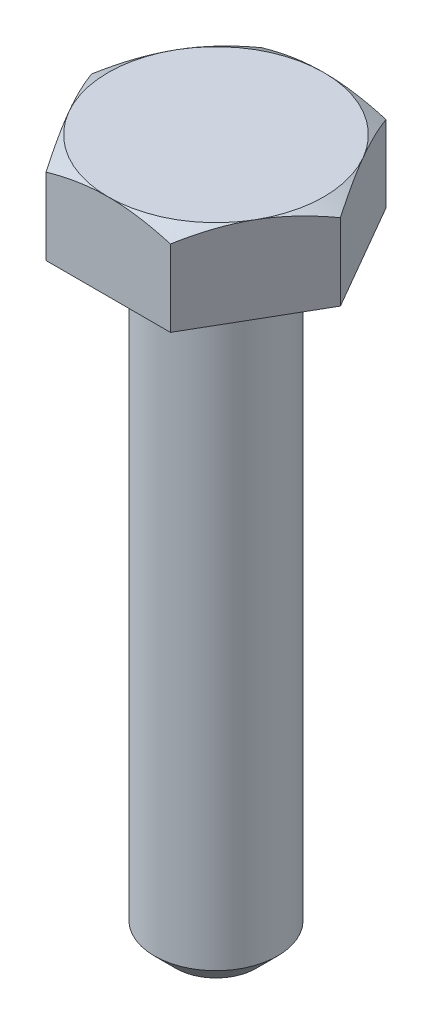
ISO-10303-21;
HEADER;
FILE_DESCRIPTION(('STEP AP214'),'2;1');
FILE_NAME('part.step','',(''),(''),'','','');
FILE_SCHEMA(('AUTOMOTIVE_DESIGN { 1 0 10303 214 1 1 1 1 }'));
ENDSEC;
DATA;
#1=APPLICATION_CONTEXT('core data for automotive mechanical design processes');
#2=APPLICATION_PROTOCOL_DEFINITION('international standard','automotive_design',2000,#1);
#3=PRODUCT_CONTEXT('',#1,'mechanical');
#4=PRODUCT('Part','Part','',(#3));
#5=PRODUCT_RELATED_PRODUCT_CATEGORY('part','',(#4));
#6=PRODUCT_DEFINITION_FORMATION('','',#4);
#7=PRODUCT_DEFINITION_CONTEXT('part definition',#1,'design');
#8=PRODUCT_DEFINITION('design','',#6,#7);
#9=PRODUCT_DEFINITION_SHAPE('','',#8);
#10=(LENGTH_UNIT() NAMED_UNIT(*) SI_UNIT(.MILLI.,.METRE.));
#11=(NAMED_UNIT(*) PLANE_ANGLE_UNIT() SI_UNIT($,.RADIAN.));
#12=(NAMED_UNIT(*) SI_UNIT($,.STERADIAN.) SOLID_ANGLE_UNIT());
#13=UNCERTAINTY_MEASURE_WITH_UNIT(LENGTH_MEASURE(1.E-05),#10,'distance_accuracy_value','');
#14=(GEOMETRIC_REPRESENTATION_CONTEXT(3) GLOBAL_UNCERTAINTY_ASSIGNED_CONTEXT((#13)) GLOBAL_UNIT_ASSIGNED_CONTEXT((#10,
#11,#12)) REPRESENTATION_CONTEXT('',''));
#15=CARTESIAN_POINT('',(0.,0.,0.));
#16=DIRECTION('',(0.,0.,1.));
#17=DIRECTION('',(1.,0.,0.));
#18=AXIS2_PLACEMENT_3D('',#15,#16,#17);
#19=CARTESIAN_POINT('',(0.,2.8,0.));
#20=DIRECTION('',(0.,-1.,0.));
#21=DIRECTION('',(1.,0.,0.));
#22=AXIS2_PLACEMENT_3D('',#19,#20,#21);
#23=PLANE('',#22);
#24=CARTESIAN_POINT('',(0.,2.79999999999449,0.));
#25=DIRECTION('',(0.,-1.,0.));
#26=DIRECTION('',(1.,0.,0.));
#27=AXIS2_PLACEMENT_3D('',#24,#25,#26);
#28=CIRCLE('',#27,3.50000000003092);
#29=CARTESIAN_POINT('',(3.03108891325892,2.80000000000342,1.75000000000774));
#30=VERTEX_POINT('',#29);
#31=CARTESIAN_POINT('',(0.,2.80000000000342,3.50000000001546));
#32=VERTEX_POINT('',#31);
#33=EDGE_CURVE('E89',#30,#32,#28,.T.);
#34=ORIENTED_EDGE('',*,*,#33,.F.);
#35=CARTESIAN_POINT('',(0.,2.79999999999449,0.));
#36=DIRECTION('',(0.,-1.,0.));
#37=DIRECTION('',(1.,0.,0.));
#38=AXIS2_PLACEMENT_3D('',#35,#36,#37);
#39=CIRCLE('',#38,3.50000000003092);
#40=CARTESIAN_POINT('',(3.03108891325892,2.80000000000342,-1.75000000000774));
#41=VERTEX_POINT('',#40);
#42=EDGE_CURVE('E87',#41,#30,#39,.T.);
#43=ORIENTED_EDGE('',*,*,#42,.F.);
#44=CARTESIAN_POINT('',(0.,2.79999999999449,0.));
#45=DIRECTION('',(0.,-1.,0.));
#46=DIRECTION('',(1.,0.,0.));
#47=AXIS2_PLACEMENT_3D('',#44,#45,#46);
#48=CIRCLE('',#47,3.50000000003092);
#49=CARTESIAN_POINT('',(0.,2.80000000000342,-3.50000000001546));
#50=VERTEX_POINT('',#49);
#51=EDGE_CURVE('E20',#50,#41,#48,.T.);
#52=ORIENTED_EDGE('',*,*,#51,.F.);
#53=CARTESIAN_POINT('',(0.,2.79999999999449,0.));
#54=DIRECTION('',(0.,-1.,0.));
#55=DIRECTION('',(1.,0.,0.));
#56=AXIS2_PLACEMENT_3D('',#53,#54,#55);
#57=CIRCLE('',#56,3.50000000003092);
#58=CARTESIAN_POINT('',(-3.03108891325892,2.80000000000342,-1.75000000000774));
#59=VERTEX_POINT('',#58);
#60=EDGE_CURVE('E104',#59,#50,#57,.T.);
#61=ORIENTED_EDGE('',*,*,#60,.F.);
#62=CARTESIAN_POINT('',(0.,2.79999999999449,0.));
#63=DIRECTION('',(0.,-1.,0.));
#64=DIRECTION('',(1.,0.,0.));
#65=AXIS2_PLACEMENT_3D('',#62,#63,#64);
#66=CIRCLE('',#65,3.50000000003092);
#67=CARTESIAN_POINT('',(-3.03108891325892,2.80000000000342,1.75000000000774));
#68=VERTEX_POINT('',#67);
#69=EDGE_CURVE('E323',#68,#59,#66,.T.);
#70=ORIENTED_EDGE('',*,*,#69,.F.);
#71=CARTESIAN_POINT('',(0.,2.79999999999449,0.));
#72=DIRECTION('',(0.,-1.,0.));
#73=DIRECTION('',(1.,0.,0.));
#74=AXIS2_PLACEMENT_3D('',#71,#72,#73);
#75=CIRCLE('',#74,3.50000000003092);
#76=EDGE_CURVE('E93',#32,#68,#75,.T.);
#77=ORIENTED_EDGE('',*,*,#76,.F.);
#78=EDGE_LOOP('',(#34,#43,#52,#61,#70,#77));
#79=FACE_BOUND('',#78,.T.);
#80=ADVANCED_FACE('F16',(#79),#23,.F.);
#81=CARTESIAN_POINT('',(0.,2.48551696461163,0.));
#82=DIRECTION('',(0.,-1.,0.));
#83=DIRECTION('',(1.,0.,0.));
#84=AXIS2_PLACEMENT_3D('',#81,#82,#83);
#85=CONICAL_SURFACE('',#84,4.04470059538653,1.04719755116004);
#86=ORIENTED_EDGE('',*,*,#51,.T.);
#87=CARTESIAN_POINT('',(2.02072594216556,2.4873926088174,-3.49999999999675));
#88=CARTESIAN_POINT('',(2.10296905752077,2.53488760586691,-3.35755074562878));
#89=CARTESIAN_POINT('',(2.18587080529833,2.5784013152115,-3.21396070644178));
#90=CARTESIAN_POINT('',(2.3524050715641,2.65513695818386,-2.92551489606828));
#91=CARTESIAN_POINT('',(2.43603178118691,2.68840978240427,-2.78066918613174));
#92=CARTESIAN_POINT('',(2.56226107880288,2.72926316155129,-2.56203362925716));
#93=CARTESIAN_POINT('',(2.60449696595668,2.741376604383,-2.48887892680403));
#94=CARTESIAN_POINT('',(2.68917094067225,2.762345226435,-2.34221930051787));
#95=CARTESIAN_POINT('',(2.7316090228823,2.771200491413,-2.26871438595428));
#96=CARTESIAN_POINT('',(2.81684436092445,2.78549717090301,-2.12108244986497));
#97=CARTESIAN_POINT('',(2.85964235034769,2.79092122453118,-2.04695415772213));
#98=CARTESIAN_POINT('',(2.94532249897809,2.79818014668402,-1.89855178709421));
#99=CARTESIAN_POINT('',(2.98820467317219,2.80001430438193,-1.82427768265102));
#100=CARTESIAN_POINT('',(3.03108891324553,2.80000000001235,-1.75000000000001));
#101=B_SPLINE_CURVE_WITH_KNOTS('',3,(#87,#88,#89,#90,#91,#92,#93,#94,#95,#96,#97,#98,#99,#100),
.UNSPECIFIED.,.F.,.F.,(4,2,2,2,2,2,4),(0.,0.513825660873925,1.02505510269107,1.28100524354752,
1.53694864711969,1.7941769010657,2.05145608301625),.UNSPECIFIED.);
#102=CARTESIAN_POINT('',(2.02072594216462,2.48739260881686,-3.49999999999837));
#103=VERTEX_POINT('',#102);
#104=EDGE_CURVE('E99',#103,#41,#101,.T.);
#105=ORIENTED_EDGE('',*,*,#104,.F.);
#106=CARTESIAN_POINT('',(0.,2.80000000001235,-3.49999999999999));
#107=CARTESIAN_POINT('',(0.0857684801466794,2.80001430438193,-3.49999999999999));
#108=CARTESIAN_POINT('',(0.171532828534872,2.79818014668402,-3.49999999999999));
#109=CARTESIAN_POINT('',(0.342893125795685,2.79092122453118,-3.49999999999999));
#110=CARTESIAN_POINT('',(0.428489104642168,2.78549717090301,-3.49999999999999));
#111=CARTESIAN_POINT('',(0.598959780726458,2.77120049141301,-3.49999999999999));
#112=CARTESIAN_POINT('',(0.683835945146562,2.76234522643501,-3.49999999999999));
#113=CARTESIAN_POINT('',(0.853183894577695,2.74137660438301,-3.49999999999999));
#114=CARTESIAN_POINT('',(0.937655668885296,2.7292631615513,-3.49999999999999));
#115=CARTESIAN_POINT('',(1.19011426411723,2.68840978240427,-3.49999999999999));
#116=CARTESIAN_POINT('',(1.35736768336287,2.65513695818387,-3.49999999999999));
#117=CARTESIAN_POINT('',(1.69043621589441,2.5784013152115,-3.49999999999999));
#118=CARTESIAN_POINT('',(1.85623971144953,2.53488760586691,-3.49999999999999));
#119=CARTESIAN_POINT('',(2.02072594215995,2.4873926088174,-3.49999999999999));
#120=B_SPLINE_CURVE_WITH_KNOTS('',3,(#106,#107,#108,#109,#110,#111,#112,#113,#114,#115,#116,
#117,#118,#119),.UNSPECIFIED.,.F.,.F.,(4,2,2,2,2,2,4),(0.,0.257279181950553,0.514507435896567,
0.770450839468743,1.02640098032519,1.53763042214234,2.05145608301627),.UNSPECIFIED.);
#121=EDGE_CURVE('E102',#50,#103,#120,.T.);
#122=ORIENTED_EDGE('',*,*,#121,.F.);
#123=EDGE_LOOP('',(#86,#105,#122));
#124=FACE_BOUND('',#123,.T.);
#125=ADVANCED_FACE('F97',(#124),#85,.T.);
#126=CARTESIAN_POINT('',(0.,2.48551696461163,0.));
#127=DIRECTION('',(0.,-1.,0.));
#128=DIRECTION('',(1.,0.,0.));
#129=AXIS2_PLACEMENT_3D('',#126,#127,#128);
#130=CONICAL_SURFACE('',#129,4.04470059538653,1.04719755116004);
#131=ORIENTED_EDGE('',*,*,#60,.T.);
#132=CARTESIAN_POINT('',(-2.02072594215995,2.4873926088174,-3.49999999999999));
#133=CARTESIAN_POINT('',(-1.85623971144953,2.53488760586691,-3.49999999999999));
#134=CARTESIAN_POINT('',(-1.69043621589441,2.5784013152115,-3.49999999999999));
#135=CARTESIAN_POINT('',(-1.35736768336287,2.65513695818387,-3.49999999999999));
#136=CARTESIAN_POINT('',(-1.19011426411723,2.68840978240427,-3.49999999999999));
#137=CARTESIAN_POINT('',(-0.937655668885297,2.7292631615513,-3.49999999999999));
#138=CARTESIAN_POINT('',(-0.853183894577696,2.74137660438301,-3.49999999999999));
#139=CARTESIAN_POINT('',(-0.683835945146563,2.76234522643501,-3.49999999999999));
#140=CARTESIAN_POINT('',(-0.598959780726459,2.77120049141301,-3.49999999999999));
#141=CARTESIAN_POINT('',(-0.428489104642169,2.78549717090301,-3.49999999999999));
#142=CARTESIAN_POINT('',(-0.342893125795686,2.79092122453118,-3.49999999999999));
#143=CARTESIAN_POINT('',(-0.171532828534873,2.79818014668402,-3.49999999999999));
#144=CARTESIAN_POINT('',(-0.0857684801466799,2.80001430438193,-3.49999999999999));
#145=CARTESIAN_POINT('',(0.,2.80000000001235,-3.49999999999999));
#146=B_SPLINE_CURVE_WITH_KNOTS('',3,(#132,#133,#134,#135,#136,#137,#138,#139,#140,#141,#142,
#143,#144,#145),.UNSPECIFIED.,.F.,.F.,(4,2,2,2,2,2,4),(0.,0.513825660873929,1.02505510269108,
1.28100524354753,1.53694864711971,1.79417690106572,2.05145608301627),.UNSPECIFIED.);
#147=CARTESIAN_POINT('',(-2.02072594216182,2.48739260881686,-3.49999999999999));
#148=VERTEX_POINT('',#147);
#149=EDGE_CURVE('E113',#148,#50,#146,.T.);
#150=ORIENTED_EDGE('',*,*,#149,.F.);
#151=CARTESIAN_POINT('',(-3.03108891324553,2.80000000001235,-1.75000000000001));
#152=CARTESIAN_POINT('',(-2.98820467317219,2.80001430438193,-1.82427768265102));
#153=CARTESIAN_POINT('',(-2.94532249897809,2.79818014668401,-1.89855178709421));
#154=CARTESIAN_POINT('',(-2.85964235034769,2.79092122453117,-2.04695415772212));
#155=CARTESIAN_POINT('',(-2.81684436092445,2.78549717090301,-2.12108244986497));
#156=CARTESIAN_POINT('',(-2.7316090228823,2.771200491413,-2.26871438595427));
#157=CARTESIAN_POINT('',(-2.68917094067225,2.762345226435,-2.34221930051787));
#158=CARTESIAN_POINT('',(-2.60449696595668,2.741376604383,-2.48887892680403));
#159=CARTESIAN_POINT('',(-2.56226107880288,2.72926316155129,-2.56203362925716));
#160=CARTESIAN_POINT('',(-2.43603178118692,2.68840978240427,-2.78066918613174));
#161=CARTESIAN_POINT('',(-2.3524050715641,2.65513695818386,-2.92551489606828));
#162=CARTESIAN_POINT('',(-2.18587080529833,2.5784013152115,-3.21396070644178));
#163=CARTESIAN_POINT('',(-2.10296905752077,2.53488760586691,-3.35755074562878));
#164=CARTESIAN_POINT('',(-2.02072594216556,2.4873926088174,-3.49999999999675));
#165=B_SPLINE_CURVE_WITH_KNOTS('',3,(#151,#152,#153,#154,#155,#156,#157,#158,#159,#160,#161,
#162,#163,#164),.UNSPECIFIED.,.F.,.F.,(4,2,2,2,2,2,4),(0.,0.257279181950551,0.514507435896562,
0.770450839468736,1.02640098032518,1.53763042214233,2.05145608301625),.UNSPECIFIED.);
#166=EDGE_CURVE('E169',#59,#148,#165,.T.);
#167=ORIENTED_EDGE('',*,*,#166,.F.);
#168=EDGE_LOOP('',(#131,#150,#167));
#169=FACE_BOUND('',#168,.T.);
#170=ADVANCED_FACE('F137',(#169),#130,.T.);
#171=CARTESIAN_POINT('',(0.,2.48551696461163,0.));
#172=DIRECTION('',(0.,-1.,0.));
#173=DIRECTION('',(1.,0.,0.));
#174=AXIS2_PLACEMENT_3D('',#171,#172,#173);
#175=CONICAL_SURFACE('',#174,4.04470059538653,1.04719755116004);
#176=ORIENTED_EDGE('',*,*,#69,.T.);
#177=CARTESIAN_POINT('',(-4.04145188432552,2.48739260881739,-3.24094856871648E-12));
#178=CARTESIAN_POINT('',(-3.95920876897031,2.5348876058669,-0.142449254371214));
#179=CARTESIAN_POINT('',(-3.87630702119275,2.57840131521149,-0.286039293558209));
#180=CARTESIAN_POINT('',(-3.70977275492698,2.65513695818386,-0.574485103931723));
#181=CARTESIAN_POINT('',(-3.62614604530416,2.68840978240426,-0.719330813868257));
#182=CARTESIAN_POINT('',(-3.49991674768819,2.72926316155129,-0.937966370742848));
#183=CARTESIAN_POINT('',(-3.45768086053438,2.741376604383,-1.01112107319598));
#184=CARTESIAN_POINT('',(-3.37300688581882,2.762345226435,-1.15778069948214));
#185=CARTESIAN_POINT('',(-3.33056880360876,2.771200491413,-1.23128561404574));
#186=CARTESIAN_POINT('',(-3.24533346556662,2.78549717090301,-1.37891755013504));
#187=CARTESIAN_POINT('',(-3.20253547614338,2.79092122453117,-1.45304584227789));
#188=CARTESIAN_POINT('',(-3.11685532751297,2.79818014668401,-1.60144821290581));
#189=CARTESIAN_POINT('',(-3.07397315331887,2.80001430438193,-1.675722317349));
#190=CARTESIAN_POINT('',(-3.03108891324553,2.80000000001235,-1.75000000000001));
#191=B_SPLINE_CURVE_WITH_KNOTS('',3,(#177,#178,#179,#180,#181,#182,#183,#184,#185,#186,#187,
#188,#189,#190),.UNSPECIFIED.,.F.,.F.,(4,2,2,2,2,2,4),(0.,0.513825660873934,1.02505510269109,
1.28100524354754,1.53694864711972,1.79417690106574,2.05145608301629),.UNSPECIFIED.);
#192=CARTESIAN_POINT('',(-4.04145188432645,2.48739260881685,-1.62018098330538E-12));
#193=VERTEX_POINT('',#192);
#194=EDGE_CURVE('E146',#193,#59,#191,.T.);
#195=ORIENTED_EDGE('',*,*,#194,.F.);
#196=CARTESIAN_POINT('',(-3.03108891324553,2.80000000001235,1.75000000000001));
#197=CARTESIAN_POINT('',(-3.07397315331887,2.80001430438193,1.675722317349));
#198=CARTESIAN_POINT('',(-3.11685532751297,2.79818014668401,1.60144821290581));
#199=CARTESIAN_POINT('',(-3.20253547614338,2.79092122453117,1.45304584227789));
#200=CARTESIAN_POINT('',(-3.24533346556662,2.78549717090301,1.37891755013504));
#201=CARTESIAN_POINT('',(-3.33056880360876,2.771200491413,1.23128561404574));
#202=CARTESIAN_POINT('',(-3.37300688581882,2.762345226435,1.15778069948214));
#203=CARTESIAN_POINT('',(-3.45768086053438,2.741376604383,1.01112107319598));
#204=CARTESIAN_POINT('',(-3.49991674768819,2.72926316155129,0.937966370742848));
#205=CARTESIAN_POINT('',(-3.62614604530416,2.68840978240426,0.719330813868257));
#206=CARTESIAN_POINT('',(-3.70977275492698,2.65513695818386,0.574485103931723));
#207=CARTESIAN_POINT('',(-3.87630702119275,2.57840131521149,0.286039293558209));
#208=CARTESIAN_POINT('',(-3.95920876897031,2.5348876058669,0.142449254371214));
#209=CARTESIAN_POINT('',(-4.04145188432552,2.48739260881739,3.2412585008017E-12));
#210=B_SPLINE_CURVE_WITH_KNOTS('',3,(#196,#197,#198,#199,#200,#201,#202,#203,#204,#205,#206,
#207,#208,#209),.UNSPECIFIED.,.F.,.F.,(4,2,2,2,2,2,4),(0.,0.257279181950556,0.514507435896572,
0.77045083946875,1.0264009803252,1.53763042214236,2.05145608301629),.UNSPECIFIED.);
#211=EDGE_CURVE('E183',#68,#193,#210,.T.);
#212=ORIENTED_EDGE('',*,*,#211,.F.);
#213=EDGE_LOOP('',(#176,#195,#212));
#214=FACE_BOUND('',#213,.T.);
#215=ADVANCED_FACE('F191',(#214),#175,.T.);
#216=CARTESIAN_POINT('',(0.,2.48551696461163,0.));
#217=DIRECTION('',(0.,-1.,0.));
#218=DIRECTION('',(1.,0.,0.));
#219=AXIS2_PLACEMENT_3D('',#216,#217,#218);
#220=CONICAL_SURFACE('',#219,4.04470059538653,1.04719755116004);
#221=ORIENTED_EDGE('',*,*,#76,.T.);
#222=CARTESIAN_POINT('',(-2.02072594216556,2.4873926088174,3.49999999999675));
#223=CARTESIAN_POINT('',(-2.10296905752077,2.53488760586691,3.35755074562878));
#224=CARTESIAN_POINT('',(-2.18587080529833,2.5784013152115,3.21396070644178));
#225=CARTESIAN_POINT('',(-2.3524050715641,2.65513695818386,2.92551489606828));
#226=CARTESIAN_POINT('',(-2.43603178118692,2.68840978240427,2.78066918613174));
#227=CARTESIAN_POINT('',(-2.56226107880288,2.72926316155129,2.56203362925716));
#228=CARTESIAN_POINT('',(-2.60449696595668,2.741376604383,2.48887892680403));
#229=CARTESIAN_POINT('',(-2.68917094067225,2.762345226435,2.34221930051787));
#230=CARTESIAN_POINT('',(-2.7316090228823,2.771200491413,2.26871438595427));
#231=CARTESIAN_POINT('',(-2.81684436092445,2.78549717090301,2.12108244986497));
#232=CARTESIAN_POINT('',(-2.85964235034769,2.79092122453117,2.04695415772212));
#233=CARTESIAN_POINT('',(-2.94532249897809,2.79818014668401,1.89855178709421));
#234=CARTESIAN_POINT('',(-2.98820467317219,2.80001430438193,1.82427768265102));
#235=CARTESIAN_POINT('',(-3.03108891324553,2.80000000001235,1.75000000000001));
#236=B_SPLINE_CURVE_WITH_KNOTS('',3,(#222,#223,#224,#225,#226,#227,#228,#229,#230,#231,#232,
#233,#234,#235),.UNSPECIFIED.,.F.,.F.,(4,2,2,2,2,2,4),(0.,0.513825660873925,1.02505510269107,
1.28100524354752,1.53694864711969,1.7941769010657,2.05145608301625),.UNSPECIFIED.);
#237=CARTESIAN_POINT('',(-2.02072594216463,2.48739260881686,3.49999999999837));
#238=VERTEX_POINT('',#237);
#239=EDGE_CURVE('E176',#238,#68,#236,.T.);
#240=ORIENTED_EDGE('',*,*,#239,.F.);
#241=CARTESIAN_POINT('',(0.,2.80000000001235,3.49999999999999));
#242=CARTESIAN_POINT('',(-0.0857684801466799,2.80001430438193,3.49999999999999));
#243=CARTESIAN_POINT('',(-0.171532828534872,2.79818014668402,3.49999999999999));
#244=CARTESIAN_POINT('',(-0.342893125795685,2.79092122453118,3.49999999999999));
#245=CARTESIAN_POINT('',(-0.428489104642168,2.78549717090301,3.49999999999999));
#246=CARTESIAN_POINT('',(-0.598959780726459,2.77120049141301,3.49999999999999));
#247=CARTESIAN_POINT('',(-0.683835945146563,2.76234522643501,3.49999999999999));
#248=CARTESIAN_POINT('',(-0.853183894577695,2.74137660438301,3.49999999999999));
#249=CARTESIAN_POINT('',(-0.937655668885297,2.7292631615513,3.49999999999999));
#250=CARTESIAN_POINT('',(-1.19011426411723,2.68840978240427,3.49999999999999));
#251=CARTESIAN_POINT('',(-1.35736768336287,2.65513695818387,3.49999999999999));
#252=CARTESIAN_POINT('',(-1.69043621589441,2.5784013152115,3.49999999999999));
#253=CARTESIAN_POINT('',(-1.85623971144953,2.53488760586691,3.49999999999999));
#254=CARTESIAN_POINT('',(-2.02072594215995,2.4873926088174,3.49999999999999));
#255=B_SPLINE_CURVE_WITH_KNOTS('',3,(#241,#242,#243,#244,#245,#246,#247,#248,#249,#250,#251,
#252,#253,#254),.UNSPECIFIED.,.F.,.F.,(4,2,2,2,2,2,4),(0.,0.257279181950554,0.514507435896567,
0.770450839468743,1.02640098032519,1.53763042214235,2.05145608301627),.UNSPECIFIED.);
#256=EDGE_CURVE('E198',#32,#238,#255,.T.);
#257=ORIENTED_EDGE('',*,*,#256,.F.);
#258=EDGE_LOOP('',(#221,#240,#257));
#259=FACE_BOUND('',#258,.T.);
#260=ADVANCED_FACE('F188',(#259),#220,.T.);
#261=CARTESIAN_POINT('',(0.,2.48551696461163,0.));
#262=DIRECTION('',(0.,-1.,0.));
#263=DIRECTION('',(1.,0.,0.));
#264=AXIS2_PLACEMENT_3D('',#261,#262,#263);
#265=CONICAL_SURFACE('',#264,4.04470059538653,1.04719755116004);
#266=ORIENTED_EDGE('',*,*,#42,.T.);
#267=CARTESIAN_POINT('',(4.04145188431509,2.48739260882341,2.13024001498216E-11));
#268=CARTESIAN_POINT('',(3.9592087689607,2.53488760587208,0.142449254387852));
#269=CARTESIAN_POINT('',(3.87630702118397,2.57840131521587,0.286039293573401));
#270=CARTESIAN_POINT('',(3.70977275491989,2.65513695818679,0.574485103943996));
#271=CARTESIAN_POINT('',(3.62614604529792,2.68840978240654,0.719330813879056));
#272=CARTESIAN_POINT('',(3.49991674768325,2.72926316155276,0.937966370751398));
#273=CARTESIAN_POINT('',(3.45768086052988,2.74137660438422,1.01112107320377));
#274=CARTESIAN_POINT('',(3.3730068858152,2.76234522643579,1.15778069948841));
#275=CARTESIAN_POINT('',(3.33056880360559,2.77120049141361,1.23128561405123));
#276=CARTESIAN_POINT('',(3.24533346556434,2.78549717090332,1.37891755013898));
#277=CARTESIAN_POINT('',(3.20253547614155,2.79092122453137,1.45304584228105));
#278=CARTESIAN_POINT('',(3.11685532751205,2.79818014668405,1.60144821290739));
#279=CARTESIAN_POINT('',(3.07397315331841,2.80001430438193,1.6757223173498));
#280=CARTESIAN_POINT('',(3.03108891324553,2.80000000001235,1.75000000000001));
#281=B_SPLINE_CURVE_WITH_KNOTS('',3,(#267,#268,#269,#270,#271,#272,#273,#274,#275,#276,#277,
#278,#279,#280),.UNSPECIFIED.,.F.,.F.,(4,2,2,2,2,2,4),(0.,0.51382566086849,1.02505510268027,
1.28100524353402,1.53694864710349,1.79417690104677,2.05145608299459),.UNSPECIFIED.);
#282=CARTESIAN_POINT('',(4.04145188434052,2.48739260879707,-1.0651035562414E-11));
#283=VERTEX_POINT('',#282);
#284=EDGE_CURVE('E109',#283,#30,#281,.T.);
#285=ORIENTED_EDGE('',*,*,#284,.F.);
#286=CARTESIAN_POINT('',(3.03108891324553,2.80000000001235,-1.75000000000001));
#287=CARTESIAN_POINT('',(3.07397315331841,2.80001430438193,-1.6757223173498));
#288=CARTESIAN_POINT('',(3.11685532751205,2.79818014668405,-1.60144821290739));
#289=CARTESIAN_POINT('',(3.20253547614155,2.79092122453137,-1.45304584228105));
#290=CARTESIAN_POINT('',(3.24533346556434,2.78549717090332,-1.37891755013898));
#291=CARTESIAN_POINT('',(3.33056880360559,2.77120049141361,-1.23128561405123));
#292=CARTESIAN_POINT('',(3.3730068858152,2.76234522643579,-1.15778069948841));
#293=CARTESIAN_POINT('',(3.45768086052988,2.74137660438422,-1.01112107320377));
#294=CARTESIAN_POINT('',(3.49991674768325,2.72926316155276,-0.937966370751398));
#295=CARTESIAN_POINT('',(3.62614604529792,2.68840978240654,-0.719330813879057));
#296=CARTESIAN_POINT('',(3.70977275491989,2.65513695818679,-0.574485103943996));
#297=CARTESIAN_POINT('',(3.87630702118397,2.57840131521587,-0.286039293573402));
#298=CARTESIAN_POINT('',(3.9592087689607,2.53488760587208,-0.142449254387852));
#299=CARTESIAN_POINT('',(4.04145188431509,2.48739260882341,-2.13026023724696E-11));
#300=B_SPLINE_CURVE_WITH_KNOTS('',3,(#286,#287,#288,#289,#290,#291,#292,#293,#294,#295,#296,
#297,#298,#299),.UNSPECIFIED.,.F.,.F.,(4,2,2,2,2,2,4),(0.,0.257279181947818,0.514507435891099,
0.770450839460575,1.02640098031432,1.5376304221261,2.05145608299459),.UNSPECIFIED.);
#301=EDGE_CURVE('E106',#41,#283,#300,.T.);
#302=ORIENTED_EDGE('',*,*,#301,.F.);
#303=EDGE_LOOP('',(#266,#285,#302));
#304=FACE_BOUND('',#303,.T.);
#305=ADVANCED_FACE('F107',(#304),#265,.T.);
#306=CARTESIAN_POINT('',(0.,2.48551696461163,0.));
#307=DIRECTION('',(0.,-1.,0.));
#308=DIRECTION('',(1.,0.,0.));
#309=AXIS2_PLACEMENT_3D('',#306,#307,#308);
#310=CONICAL_SURFACE('',#309,4.04470059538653,1.04719755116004);
#311=ORIENTED_EDGE('',*,*,#33,.T.);
#312=CARTESIAN_POINT('',(2.02072594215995,2.4873926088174,3.49999999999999));
#313=CARTESIAN_POINT('',(1.85623971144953,2.53488760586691,3.49999999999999));
#314=CARTESIAN_POINT('',(1.69043621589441,2.5784013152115,3.49999999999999));
#315=CARTESIAN_POINT('',(1.35736768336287,2.65513695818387,3.49999999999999));
#316=CARTESIAN_POINT('',(1.19011426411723,2.68840978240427,3.49999999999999));
#317=CARTESIAN_POINT('',(0.937655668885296,2.7292631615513,3.49999999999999));
#318=CARTESIAN_POINT('',(0.853183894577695,2.74137660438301,3.49999999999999));
#319=CARTESIAN_POINT('',(0.683835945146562,2.76234522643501,3.49999999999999));
#320=CARTESIAN_POINT('',(0.598959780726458,2.77120049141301,3.49999999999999));
#321=CARTESIAN_POINT('',(0.428489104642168,2.78549717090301,3.49999999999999));
#322=CARTESIAN_POINT('',(0.342893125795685,2.79092122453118,3.49999999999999));
#323=CARTESIAN_POINT('',(0.171532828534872,2.79818014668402,3.49999999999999));
#324=CARTESIAN_POINT('',(0.0857684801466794,2.80001430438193,3.49999999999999));
#325=CARTESIAN_POINT('',(0.,2.80000000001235,3.49999999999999));
#326=B_SPLINE_CURVE_WITH_KNOTS('',3,(#312,#313,#314,#315,#316,#317,#318,#319,#320,#321,#322,
#323,#324,#325),.UNSPECIFIED.,.F.,.F.,(4,2,2,2,2,2,4),(0.,0.513825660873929,1.02505510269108,
1.28100524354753,1.53694864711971,1.79417690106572,2.05145608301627),.UNSPECIFIED.);
#327=CARTESIAN_POINT('',(2.02072594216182,2.48739260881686,3.49999999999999));
#328=VERTEX_POINT('',#327);
#329=EDGE_CURVE('E205',#328,#32,#326,.T.);
#330=ORIENTED_EDGE('',*,*,#329,.F.);
#331=CARTESIAN_POINT('',(3.03108891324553,2.80000000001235,1.75000000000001));
#332=CARTESIAN_POINT('',(2.98820467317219,2.80001430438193,1.82427768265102));
#333=CARTESIAN_POINT('',(2.94532249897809,2.79818014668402,1.89855178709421));
#334=CARTESIAN_POINT('',(2.85964235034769,2.79092122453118,2.04695415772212));
#335=CARTESIAN_POINT('',(2.81684436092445,2.78549717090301,2.12108244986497));
#336=CARTESIAN_POINT('',(2.7316090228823,2.771200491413,2.26871438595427));
#337=CARTESIAN_POINT('',(2.68917094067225,2.762345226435,2.34221930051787));
#338=CARTESIAN_POINT('',(2.60449696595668,2.741376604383,2.48887892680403));
#339=CARTESIAN_POINT('',(2.56226107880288,2.72926316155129,2.56203362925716));
#340=CARTESIAN_POINT('',(2.43603178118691,2.68840978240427,2.78066918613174));
#341=CARTESIAN_POINT('',(2.3524050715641,2.65513695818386,2.92551489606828));
#342=CARTESIAN_POINT('',(2.18587080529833,2.5784013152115,3.21396070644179));
#343=CARTESIAN_POINT('',(2.10296905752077,2.53488760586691,3.35755074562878));
#344=CARTESIAN_POINT('',(2.02072594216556,2.4873926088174,3.49999999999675));
#345=B_SPLINE_CURVE_WITH_KNOTS('',3,(#331,#332,#333,#334,#335,#336,#337,#338,#339,#340,#341,
#342,#343,#344),.UNSPECIFIED.,.F.,.F.,(4,2,2,2,2,2,4),(0.,0.257279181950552,0.514507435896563,
0.770450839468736,1.02640098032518,1.53763042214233,2.05145608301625),.UNSPECIFIED.);
#346=EDGE_CURVE('E225',#30,#328,#345,.T.);
#347=ORIENTED_EDGE('',*,*,#346,.F.);
#348=EDGE_LOOP('',(#311,#330,#347));
#349=FACE_BOUND('',#348,.T.);
#350=ADVANCED_FACE('F233',(#349),#310,.T.);
#351=CARTESIAN_POINT('',(0.,-20.,0.));
#352=DIRECTION('',(0.,1.,0.));
#353=DIRECTION('',(0.,0.,1.));
#354=AXIS2_PLACEMENT_3D('',#351,#352,#353);
#355=PLANE('',#354);
#356=CARTESIAN_POINT('',(0.,-19.999999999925,0.));
#357=DIRECTION('',(0.,1.,0.));
#358=DIRECTION('',(0.,0.,1.));
#359=AXIS2_PLACEMENT_3D('',#356,#357,#358);
#360=CIRCLE('',#359,1.30000000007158);
#361=CARTESIAN_POINT('',(0.,-19.999999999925,1.30000000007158));
#362=VERTEX_POINT('',#361);
#363=EDGE_CURVE('E232',#362,#362,#360,.T.);
#364=ORIENTED_EDGE('',*,*,#363,.F.);
#365=EDGE_LOOP('',(#364));
#366=FACE_BOUND('',#365,.T.);
#367=ADVANCED_FACE('F236',(#366),#355,.F.);
#368=CARTESIAN_POINT('',(2.02072594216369,16.94,-3.49999999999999));
#369=DIRECTION('',(0.866025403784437,0.,-0.500000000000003));
#370=DIRECTION('',(-0.500000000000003,0.,-0.866025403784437));
#371=AXIS2_PLACEMENT_3D('',#368,#369,#370);
#372=PLANE('',#371);
#373=DIRECTION('',(-0.500000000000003,0.,-0.866025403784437));
#374=VECTOR('',#373,1.);
#375=CARTESIAN_POINT('',(4.04145188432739,0.,0.));
#376=LINE('',#375,#374);
#377=CARTESIAN_POINT('',(4.04145188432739,0.,0.));
#378=VERTEX_POINT('',#377);
#379=CARTESIAN_POINT('',(2.02072594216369,0.,-3.49999999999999));
#380=VERTEX_POINT('',#379);
#381=EDGE_CURVE('E268',#378,#380,#376,.T.);
#382=ORIENTED_EDGE('',*,*,#381,.T.);
#383=DIRECTION('',(0.,1.,0.));
#384=VECTOR('',#383,1.);
#385=CARTESIAN_POINT('',(2.02072594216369,16.94,-3.49999999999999));
#386=LINE('',#385,#384);
#387=EDGE_CURVE('E117',#103,#380,#386,.F.);
#388=ORIENTED_EDGE('',*,*,#387,.F.);
#389=ORIENTED_EDGE('',*,*,#104,.T.);
#390=ORIENTED_EDGE('',*,*,#301,.T.);
#391=DIRECTION('',(0.,1.,0.));
#392=VECTOR('',#391,1.);
#393=CARTESIAN_POINT('',(4.04145188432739,16.94,0.));
#394=LINE('',#393,#392);
#395=EDGE_CURVE('E312',#378,#283,#394,.T.);
#396=ORIENTED_EDGE('',*,*,#395,.F.);
#397=EDGE_LOOP('',(#382,#388,#389,#390,#396));
#398=FACE_BOUND('',#397,.T.);
#399=ADVANCED_FACE('F115',(#398),#372,.T.);
#400=CARTESIAN_POINT('',(-2.02072594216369,16.94,-3.49999999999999));
#401=DIRECTION('',(0.,0.,-1.));
#402=DIRECTION('',(-1.,0.,0.));
#403=AXIS2_PLACEMENT_3D('',#400,#401,#402);
#404=PLANE('',#403);
#405=DIRECTION('',(-1.,0.,0.));
#406=VECTOR('',#405,1.);
#407=CARTESIAN_POINT('',(0.,0.,-3.49999999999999));
#408=LINE('',#407,#406);
#409=CARTESIAN_POINT('',(-2.02072594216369,0.,-3.49999999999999));
#410=VERTEX_POINT('',#409);
#411=EDGE_CURVE('E270',#380,#410,#408,.T.);
#412=ORIENTED_EDGE('',*,*,#411,.T.);
#413=DIRECTION('',(0.,1.,0.));
#414=VECTOR('',#413,1.);
#415=CARTESIAN_POINT('',(-2.02072594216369,16.94,-3.49999999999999));
#416=LINE('',#415,#414);
#417=EDGE_CURVE('E175',#148,#410,#416,.F.);
#418=ORIENTED_EDGE('',*,*,#417,.F.);
#419=ORIENTED_EDGE('',*,*,#149,.T.);
#420=ORIENTED_EDGE('',*,*,#121,.T.);
#421=ORIENTED_EDGE('',*,*,#387,.T.);
#422=EDGE_LOOP('',(#412,#418,#419,#420,#421));
#423=FACE_BOUND('',#422,.T.);
#424=ADVANCED_FACE('F155',(#423),#404,.T.);
#425=CARTESIAN_POINT('',(-2.02072594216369,16.94,-3.49999999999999));
#426=DIRECTION('',(-0.866025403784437,0.,-0.500000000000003));
#427=DIRECTION('',(-0.500000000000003,0.,0.866025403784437));
#428=AXIS2_PLACEMENT_3D('',#425,#426,#427);
#429=PLANE('',#428);
#430=DIRECTION('',(-0.500000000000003,0.,0.866025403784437));
#431=VECTOR('',#430,1.);
#432=CARTESIAN_POINT('',(-2.02072594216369,0.,-3.49999999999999));
#433=LINE('',#432,#431);
#434=CARTESIAN_POINT('',(-4.04145188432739,0.,0.));
#435=VERTEX_POINT('',#434);
#436=EDGE_CURVE('E278',#410,#435,#433,.T.);
#437=ORIENTED_EDGE('',*,*,#436,.T.);
#438=DIRECTION('',(0.,1.,0.));
#439=VECTOR('',#438,1.);
#440=CARTESIAN_POINT('',(-4.04145188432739,16.94,0.));
#441=LINE('',#440,#439);
#442=EDGE_CURVE('E302',#193,#435,#441,.F.);
#443=ORIENTED_EDGE('',*,*,#442,.F.);
#444=ORIENTED_EDGE('',*,*,#194,.T.);
#445=ORIENTED_EDGE('',*,*,#166,.T.);
#446=ORIENTED_EDGE('',*,*,#417,.T.);
#447=EDGE_LOOP('',(#437,#443,#444,#445,#446));
#448=FACE_BOUND('',#447,.T.);
#449=ADVANCED_FACE('F158',(#448),#429,.T.);
#450=CARTESIAN_POINT('',(-2.02072594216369,16.94,3.49999999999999));
#451=DIRECTION('',(-0.866025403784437,0.,0.500000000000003));
#452=DIRECTION('',(0.500000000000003,0.,0.866025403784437));
#453=AXIS2_PLACEMENT_3D('',#450,#451,#452);
#454=PLANE('',#453);
#455=DIRECTION('',(0.500000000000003,0.,0.866025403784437));
#456=VECTOR('',#455,1.);
#457=CARTESIAN_POINT('',(-4.04145188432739,0.,0.));
#458=LINE('',#457,#456);
#459=CARTESIAN_POINT('',(-2.02072594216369,0.,3.49999999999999));
#460=VERTEX_POINT('',#459);
#461=EDGE_CURVE('E274',#435,#460,#458,.T.);
#462=ORIENTED_EDGE('',*,*,#461,.T.);
#463=DIRECTION('',(0.,1.,0.));
#464=VECTOR('',#463,1.);
#465=CARTESIAN_POINT('',(-2.02072594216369,16.94,3.49999999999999));
#466=LINE('',#465,#464);
#467=EDGE_CURVE('E204',#238,#460,#466,.F.);
#468=ORIENTED_EDGE('',*,*,#467,.F.);
#469=ORIENTED_EDGE('',*,*,#239,.T.);
#470=ORIENTED_EDGE('',*,*,#211,.T.);
#471=ORIENTED_EDGE('',*,*,#442,.T.);
#472=EDGE_LOOP('',(#462,#468,#469,#470,#471));
#473=FACE_BOUND('',#472,.T.);
#474=ADVANCED_FACE('F164',(#473),#454,.T.);
#475=CARTESIAN_POINT('',(-2.02072594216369,16.94,3.49999999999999));
#476=DIRECTION('',(0.,0.,1.));
#477=DIRECTION('',(1.,0.,0.));
#478=AXIS2_PLACEMENT_3D('',#475,#476,#477);
#479=PLANE('',#478);
#480=DIRECTION('',(-1.,0.,0.));
#481=VECTOR('',#480,1.);
#482=CARTESIAN_POINT('',(0.,0.,3.49999999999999));
#483=LINE('',#482,#481);
#484=CARTESIAN_POINT('',(2.02072594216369,0.,3.49999999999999));
#485=VERTEX_POINT('',#484);
#486=EDGE_CURVE('E35',#460,#485,#483,.F.);
#487=ORIENTED_EDGE('',*,*,#486,.T.);
#488=DIRECTION('',(0.,1.,0.));
#489=VECTOR('',#488,1.);
#490=CARTESIAN_POINT('',(2.02072594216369,16.94,3.49999999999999));
#491=LINE('',#490,#489);
#492=EDGE_CURVE('E231',#328,#485,#491,.F.);
#493=ORIENTED_EDGE('',*,*,#492,.F.);
#494=ORIENTED_EDGE('',*,*,#329,.T.);
#495=ORIENTED_EDGE('',*,*,#256,.T.);
#496=ORIENTED_EDGE('',*,*,#467,.T.);
#497=EDGE_LOOP('',(#487,#493,#494,#495,#496));
#498=FACE_BOUND('',#497,.T.);
#499=ADVANCED_FACE('F214',(#498),#479,.T.);
#500=CARTESIAN_POINT('',(2.02072594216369,16.94,3.49999999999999));
#501=DIRECTION('',(0.866025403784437,0.,0.500000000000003));
#502=DIRECTION('',(0.500000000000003,0.,-0.866025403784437));
#503=AXIS2_PLACEMENT_3D('',#500,#501,#502);
#504=PLANE('',#503);
#505=DIRECTION('',(0.500000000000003,0.,-0.866025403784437));
#506=VECTOR('',#505,1.);
#507=CARTESIAN_POINT('',(2.02072594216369,0.,3.49999999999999));
#508=LINE('',#507,#506);
#509=EDGE_CURVE('E258',#485,#378,#508,.T.);
#510=ORIENTED_EDGE('',*,*,#509,.T.);
#511=ORIENTED_EDGE('',*,*,#395,.T.);
#512=ORIENTED_EDGE('',*,*,#284,.T.);
#513=ORIENTED_EDGE('',*,*,#346,.T.);
#514=ORIENTED_EDGE('',*,*,#492,.T.);
#515=EDGE_LOOP('',(#510,#511,#512,#513,#514));
#516=FACE_BOUND('',#515,.T.);
#517=ADVANCED_FACE('F217',(#516),#504,.T.);
#518=CARTESIAN_POINT('',(0.,-19.3000000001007,0.));
#519=DIRECTION('',(0.,1.,0.));
#520=DIRECTION('',(0.,0.,1.));
#521=AXIS2_PLACEMENT_3D('',#518,#519,#520);
#522=CONICAL_SURFACE('',#521,1.99999999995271,0.785398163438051);
#523=CARTESIAN_POINT('',(0.,-19.3,0.));
#524=DIRECTION('',(0.,1.,0.));
#525=DIRECTION('',(0.,0.,1.));
#526=AXIS2_PLACEMENT_3D('',#523,#524,#525);
#527=CIRCLE('',#526,2.);
#528=CARTESIAN_POINT('',(0.,-19.3,2.));
#529=VERTEX_POINT('',#528);
#530=EDGE_CURVE('E26',#529,#529,#527,.T.);
#531=ORIENTED_EDGE('',*,*,#530,.F.);
#532=EDGE_LOOP('',(#531));
#533=FACE_BOUND('',#532,.T.);
#534=ORIENTED_EDGE('',*,*,#363,.T.);
#535=EDGE_LOOP('',(#534));
#536=FACE_BOUND('',#535,.T.);
#537=ADVANCED_FACE('F222',(#533,#536),#522,.T.);
#538=CARTESIAN_POINT('',(0.,0.,0.));
#539=DIRECTION('',(0.,1.,0.));
#540=DIRECTION('',(-1.,0.,0.));
#541=AXIS2_PLACEMENT_3D('',#538,#539,#540);
#542=PLANE('',#541);
#543=ORIENTED_EDGE('',*,*,#486,.F.);
#544=ORIENTED_EDGE('',*,*,#461,.F.);
#545=ORIENTED_EDGE('',*,*,#436,.F.);
#546=ORIENTED_EDGE('',*,*,#411,.F.);
#547=ORIENTED_EDGE('',*,*,#381,.F.);
#548=ORIENTED_EDGE('',*,*,#509,.F.);
#549=EDGE_LOOP('',(#543,#544,#545,#546,#547,#548));
#550=FACE_BOUND('',#549,.T.);
#551=CARTESIAN_POINT('',(0.,0.,0.));
#552=DIRECTION('',(0.,1.,0.));
#553=DIRECTION('',(0.,0.,1.));
#554=AXIS2_PLACEMENT_3D('',#551,#552,#553);
#555=CIRCLE('',#554,2.);
#556=CARTESIAN_POINT('',(0.,0.,2.));
#557=VERTEX_POINT('',#556);
#558=EDGE_CURVE('E10',#557,#557,#555,.F.);
#559=ORIENTED_EDGE('',*,*,#558,.F.);
#560=EDGE_LOOP('',(#559));
#561=FACE_BOUND('',#560,.T.);
#562=ADVANCED_FACE('F247',(#550,#561),#542,.F.);
#563=CARTESIAN_POINT('',(0.,-20.,0.));
#564=DIRECTION('',(0.,1.,0.));
#565=DIRECTION('',(0.,0.,1.));
#566=AXIS2_PLACEMENT_3D('',#563,#564,#565);
#567=CYLINDRICAL_SURFACE('',#566,2.);
#568=ORIENTED_EDGE('',*,*,#558,.T.);
#569=EDGE_LOOP('',(#568));
#570=FACE_BOUND('',#569,.T.);
#571=ORIENTED_EDGE('',*,*,#530,.T.);
#572=EDGE_LOOP('',(#571));
#573=FACE_BOUND('',#572,.T.);
#574=ADVANCED_FACE('F18',(#570,#573),#567,.T.);
#575=CLOSED_SHELL('',(#80,#125,#170,#215,#260,#305,#350,#367,#399,#424,#449,#474,#499,#517,#537,
#562,#574));
#576=MANIFOLD_SOLID_BREP('B1',#575);
#577=ADVANCED_BREP_SHAPE_REPRESENTATION('',(#18,#576),#14);
#578=SHAPE_DEFINITION_REPRESENTATION(#9,#577);
ENDSEC;
END-ISO-10303-21;
